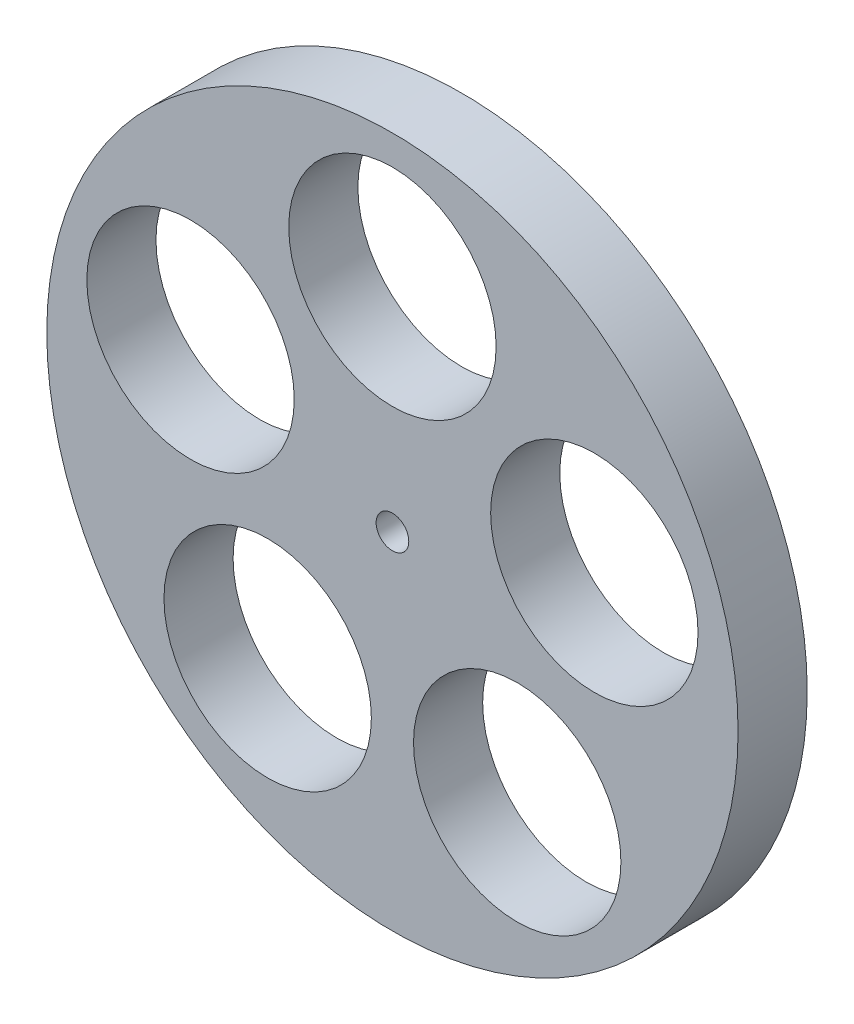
ISO-10303-21;
HEADER;
FILE_DESCRIPTION(('STEP AP214'),'2;1');
FILE_NAME('part.step','',(''),(''),'','','');
FILE_SCHEMA(('AUTOMOTIVE_DESIGN { 1 0 10303 214 1 1 1 1 }'));
ENDSEC;
DATA;
#1=APPLICATION_CONTEXT('core data for automotive mechanical design processes');
#2=APPLICATION_PROTOCOL_DEFINITION('international standard','automotive_design',2000,#1);
#3=PRODUCT_CONTEXT('',#1,'mechanical');
#4=PRODUCT('Part','Part','',(#3));
#5=PRODUCT_RELATED_PRODUCT_CATEGORY('part','',(#4));
#6=PRODUCT_DEFINITION_FORMATION('','',#4);
#7=PRODUCT_DEFINITION_CONTEXT('part definition',#1,'design');
#8=PRODUCT_DEFINITION('design','',#6,#7);
#9=PRODUCT_DEFINITION_SHAPE('','',#8);
#10=(LENGTH_UNIT() NAMED_UNIT(*) SI_UNIT(.MILLI.,.METRE.));
#11=(NAMED_UNIT(*) PLANE_ANGLE_UNIT() SI_UNIT($,.RADIAN.));
#12=(NAMED_UNIT(*) SI_UNIT($,.STERADIAN.) SOLID_ANGLE_UNIT());
#13=UNCERTAINTY_MEASURE_WITH_UNIT(LENGTH_MEASURE(1.E-05),#10,'distance_accuracy_value','');
#14=(GEOMETRIC_REPRESENTATION_CONTEXT(3) GLOBAL_UNCERTAINTY_ASSIGNED_CONTEXT((#13)) GLOBAL_UNIT_ASSIGNED_CONTEXT((#10,
#11,#12)) REPRESENTATION_CONTEXT('',''));
#15=CARTESIAN_POINT('',(0.,0.,0.));
#16=DIRECTION('',(0.,0.,1.));
#17=DIRECTION('',(1.,0.,0.));
#18=AXIS2_PLACEMENT_3D('',#15,#16,#17);
#19=CARTESIAN_POINT('',(0.,0.,12.7));
#20=DIRECTION('',(0.,0.,1.));
#21=DIRECTION('',(1.,0.,0.));
#22=AXIS2_PLACEMENT_3D('',#19,#20,#21);
#23=PLANE('',#22);
#24=CARTESIAN_POINT('',(-22.9236248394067,-31.5516627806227,12.7));
#25=DIRECTION('',(0.,0.,1.));
#26=DIRECTION('',(1.,0.,0.));
#27=AXIS2_PLACEMENT_3D('',#24,#25,#26);
#28=CIRCLE('',#27,19.05);
#29=CARTESIAN_POINT('',(-3.87362483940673,-31.5516627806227,12.7));
#30=VERTEX_POINT('',#29);
#31=EDGE_CURVE('E86',#30,#30,#28,.T.);
#32=ORIENTED_EDGE('',*,*,#31,.F.);
#33=EDGE_LOOP('',(#32));
#34=FACE_BOUND('',#33,.T.);
#35=CARTESIAN_POINT('',(37.091204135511,12.0516627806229,12.7));
#36=DIRECTION('',(0.,0.,1.));
#37=DIRECTION('',(1.,0.,0.));
#38=AXIS2_PLACEMENT_3D('',#35,#36,#37);
#39=CIRCLE('',#38,19.05);
#40=CARTESIAN_POINT('',(56.141204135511,12.0516627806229,12.7));
#41=VERTEX_POINT('',#40);
#42=EDGE_CURVE('E70',#41,#41,#39,.T.);
#43=ORIENTED_EDGE('',*,*,#42,.F.);
#44=EDGE_LOOP('',(#43));
#45=FACE_BOUND('',#44,.T.);
#46=CARTESIAN_POINT('',(0.,0.,12.7));
#47=DIRECTION('',(0.,0.,1.));
#48=DIRECTION('',(1.,0.,0.));
#49=AXIS2_PLACEMENT_3D('',#46,#47,#48);
#50=CIRCLE('',#49,3.);
#51=CARTESIAN_POINT('',(3.,0.,12.7));
#52=VERTEX_POINT('',#51);
#53=EDGE_CURVE('E56',#52,#52,#50,.T.);
#54=ORIENTED_EDGE('',*,*,#53,.F.);
#55=EDGE_LOOP('',(#54));
#56=FACE_BOUND('',#55,.T.);
#57=CARTESIAN_POINT('',(0.,0.,12.7));
#58=DIRECTION('',(0.,0.,1.));
#59=DIRECTION('',(1.,0.,0.));
#60=AXIS2_PLACEMENT_3D('',#57,#58,#59);
#61=CIRCLE('',#60,63.5);
#62=CARTESIAN_POINT('',(63.5,0.,12.7));
#63=VERTEX_POINT('',#62);
#64=EDGE_CURVE('E10',#63,#63,#61,.T.);
#65=ORIENTED_EDGE('',*,*,#64,.T.);
#66=EDGE_LOOP('',(#65));
#67=FACE_BOUND('',#66,.T.);
#68=CARTESIAN_POINT('',(0.,39.,12.7));
#69=DIRECTION('',(0.,0.,1.));
#70=DIRECTION('',(1.,0.,0.));
#71=AXIS2_PLACEMENT_3D('',#68,#69,#70);
#72=CIRCLE('',#71,19.05);
#73=CARTESIAN_POINT('',(19.05,39.,12.7));
#74=VERTEX_POINT('',#73);
#75=EDGE_CURVE('E62',#74,#74,#72,.T.);
#76=ORIENTED_EDGE('',*,*,#75,.F.);
#77=EDGE_LOOP('',(#76));
#78=FACE_BOUND('',#77,.T.);
#79=CARTESIAN_POINT('',(22.9236248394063,-31.5516627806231,12.7));
#80=DIRECTION('',(0.,0.,1.));
#81=DIRECTION('',(1.,0.,0.));
#82=AXIS2_PLACEMENT_3D('',#79,#80,#81);
#83=CIRCLE('',#82,19.05);
#84=CARTESIAN_POINT('',(41.9736248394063,-31.5516627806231,12.7));
#85=VERTEX_POINT('',#84);
#86=EDGE_CURVE('E78',#85,#85,#83,.T.);
#87=ORIENTED_EDGE('',*,*,#86,.F.);
#88=EDGE_LOOP('',(#87));
#89=FACE_BOUND('',#88,.T.);
#90=CARTESIAN_POINT('',(-37.0912041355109,12.0516627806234,12.7));
#91=DIRECTION('',(0.,0.,1.));
#92=DIRECTION('',(1.,0.,0.));
#93=AXIS2_PLACEMENT_3D('',#90,#91,#92);
#94=CIRCLE('',#93,19.05);
#95=CARTESIAN_POINT('',(-18.0412041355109,12.0516627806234,12.7));
#96=VERTEX_POINT('',#95);
#97=EDGE_CURVE('E94',#96,#96,#94,.T.);
#98=ORIENTED_EDGE('',*,*,#97,.F.);
#99=EDGE_LOOP('',(#98));
#100=FACE_BOUND('',#99,.T.);
#101=ADVANCED_FACE('F43',(#34,#45,#56,#67,#78,#89,#100),#23,.T.);
#102=CARTESIAN_POINT('',(0.,0.,0.));
#103=DIRECTION('',(0.,0.,1.));
#104=DIRECTION('',(1.,0.,0.));
#105=AXIS2_PLACEMENT_3D('',#102,#103,#104);
#106=PLANE('',#105);
#107=CARTESIAN_POINT('',(0.,0.,0.));
#108=DIRECTION('',(0.,0.,1.));
#109=DIRECTION('',(1.,0.,0.));
#110=AXIS2_PLACEMENT_3D('',#107,#108,#109);
#111=CIRCLE('',#110,63.5);
#112=CARTESIAN_POINT('',(63.5,0.,0.));
#113=VERTEX_POINT('',#112);
#114=EDGE_CURVE('E47',#113,#113,#111,.T.);
#115=ORIENTED_EDGE('',*,*,#114,.F.);
#116=EDGE_LOOP('',(#115));
#117=FACE_BOUND('',#116,.T.);
#118=CARTESIAN_POINT('',(0.,0.,0.));
#119=DIRECTION('',(0.,0.,1.));
#120=DIRECTION('',(1.,0.,0.));
#121=AXIS2_PLACEMENT_3D('',#118,#119,#120);
#122=CIRCLE('',#121,3.);
#123=CARTESIAN_POINT('',(3.,0.,0.));
#124=VERTEX_POINT('',#123);
#125=EDGE_CURVE('E58',#124,#124,#122,.T.);
#126=ORIENTED_EDGE('',*,*,#125,.T.);
#127=EDGE_LOOP('',(#126));
#128=FACE_BOUND('',#127,.T.);
#129=CARTESIAN_POINT('',(0.,39.,0.));
#130=DIRECTION('',(0.,0.,1.));
#131=DIRECTION('',(1.,0.,0.));
#132=AXIS2_PLACEMENT_3D('',#129,#130,#131);
#133=CIRCLE('',#132,19.05);
#134=CARTESIAN_POINT('',(19.05,39.,0.));
#135=VERTEX_POINT('',#134);
#136=EDGE_CURVE('E66',#135,#135,#133,.T.);
#137=ORIENTED_EDGE('',*,*,#136,.T.);
#138=EDGE_LOOP('',(#137));
#139=FACE_BOUND('',#138,.T.);
#140=CARTESIAN_POINT('',(37.091204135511,12.0516627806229,0.));
#141=DIRECTION('',(0.,0.,1.));
#142=DIRECTION('',(1.,0.,0.));
#143=AXIS2_PLACEMENT_3D('',#140,#141,#142);
#144=CIRCLE('',#143,19.05);
#145=CARTESIAN_POINT('',(56.141204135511,12.0516627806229,0.));
#146=VERTEX_POINT('',#145);
#147=EDGE_CURVE('E74',#146,#146,#144,.T.);
#148=ORIENTED_EDGE('',*,*,#147,.T.);
#149=EDGE_LOOP('',(#148));
#150=FACE_BOUND('',#149,.T.);
#151=CARTESIAN_POINT('',(22.9236248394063,-31.5516627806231,0.));
#152=DIRECTION('',(0.,0.,1.));
#153=DIRECTION('',(1.,0.,0.));
#154=AXIS2_PLACEMENT_3D('',#151,#152,#153);
#155=CIRCLE('',#154,19.05);
#156=CARTESIAN_POINT('',(41.9736248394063,-31.5516627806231,0.));
#157=VERTEX_POINT('',#156);
#158=EDGE_CURVE('E82',#157,#157,#155,.T.);
#159=ORIENTED_EDGE('',*,*,#158,.T.);
#160=EDGE_LOOP('',(#159));
#161=FACE_BOUND('',#160,.T.);
#162=CARTESIAN_POINT('',(-22.9236248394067,-31.5516627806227,0.));
#163=DIRECTION('',(0.,0.,1.));
#164=DIRECTION('',(1.,0.,0.));
#165=AXIS2_PLACEMENT_3D('',#162,#163,#164);
#166=CIRCLE('',#165,19.05);
#167=CARTESIAN_POINT('',(-3.87362483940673,-31.5516627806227,0.));
#168=VERTEX_POINT('',#167);
#169=EDGE_CURVE('E90',#168,#168,#166,.T.);
#170=ORIENTED_EDGE('',*,*,#169,.T.);
#171=EDGE_LOOP('',(#170));
#172=FACE_BOUND('',#171,.T.);
#173=CARTESIAN_POINT('',(-37.0912041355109,12.0516627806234,0.));
#174=DIRECTION('',(0.,0.,1.));
#175=DIRECTION('',(1.,0.,0.));
#176=AXIS2_PLACEMENT_3D('',#173,#174,#175);
#177=CIRCLE('',#176,19.05);
#178=CARTESIAN_POINT('',(-18.0412041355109,12.0516627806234,0.));
#179=VERTEX_POINT('',#178);
#180=EDGE_CURVE('E98',#179,#179,#177,.T.);
#181=ORIENTED_EDGE('',*,*,#180,.T.);
#182=EDGE_LOOP('',(#181));
#183=FACE_BOUND('',#182,.T.);
#184=ADVANCED_FACE('F110',(#117,#128,#139,#150,#161,#172,#183),#106,.F.);
#185=CARTESIAN_POINT('',(0.,0.,12.7));
#186=DIRECTION('',(0.,0.,-1.));
#187=DIRECTION('',(-1.,0.,0.));
#188=AXIS2_PLACEMENT_3D('',#185,#186,#187);
#189=CYLINDRICAL_SURFACE('',#188,63.5);
#190=ORIENTED_EDGE('',*,*,#64,.F.);
#191=EDGE_LOOP('',(#190));
#192=FACE_BOUND('',#191,.T.);
#193=ORIENTED_EDGE('',*,*,#114,.T.);
#194=EDGE_LOOP('',(#193));
#195=FACE_BOUND('',#194,.T.);
#196=ADVANCED_FACE('F45',(#192,#195),#189,.T.);
#197=CARTESIAN_POINT('',(0.,0.,12.7));
#198=DIRECTION('',(0.,0.,-1.));
#199=DIRECTION('',(-1.,0.,0.));
#200=AXIS2_PLACEMENT_3D('',#197,#198,#199);
#201=CYLINDRICAL_SURFACE('',#200,3.);
#202=ORIENTED_EDGE('',*,*,#53,.T.);
#203=EDGE_LOOP('',(#202));
#204=FACE_BOUND('',#203,.T.);
#205=ORIENTED_EDGE('',*,*,#125,.F.);
#206=EDGE_LOOP('',(#205));
#207=FACE_BOUND('',#206,.T.);
#208=ADVANCED_FACE('F120',(#204,#207),#201,.F.);
#209=CARTESIAN_POINT('',(0.,39.,12.7));
#210=DIRECTION('',(0.,0.,-1.));
#211=DIRECTION('',(-1.,0.,0.));
#212=AXIS2_PLACEMENT_3D('',#209,#210,#211);
#213=CYLINDRICAL_SURFACE('',#212,19.05);
#214=ORIENTED_EDGE('',*,*,#75,.T.);
#215=EDGE_LOOP('',(#214));
#216=FACE_BOUND('',#215,.T.);
#217=ORIENTED_EDGE('',*,*,#136,.F.);
#218=EDGE_LOOP('',(#217));
#219=FACE_BOUND('',#218,.T.);
#220=ADVANCED_FACE('F123',(#216,#219),#213,.F.);
#221=CARTESIAN_POINT('',(37.091204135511,12.0516627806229,12.7));
#222=DIRECTION('',(0.,0.,-1.));
#223=DIRECTION('',(-1.,0.,0.));
#224=AXIS2_PLACEMENT_3D('',#221,#222,#223);
#225=CYLINDRICAL_SURFACE('',#224,19.05);
#226=ORIENTED_EDGE('',*,*,#42,.T.);
#227=EDGE_LOOP('',(#226));
#228=FACE_BOUND('',#227,.T.);
#229=ORIENTED_EDGE('',*,*,#147,.F.);
#230=EDGE_LOOP('',(#229));
#231=FACE_BOUND('',#230,.T.);
#232=ADVANCED_FACE('F127',(#228,#231),#225,.F.);
#233=CARTESIAN_POINT('',(22.9236248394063,-31.5516627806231,12.7));
#234=DIRECTION('',(0.,0.,-1.));
#235=DIRECTION('',(-1.,0.,0.));
#236=AXIS2_PLACEMENT_3D('',#233,#234,#235);
#237=CYLINDRICAL_SURFACE('',#236,19.05);
#238=ORIENTED_EDGE('',*,*,#86,.T.);
#239=EDGE_LOOP('',(#238));
#240=FACE_BOUND('',#239,.T.);
#241=ORIENTED_EDGE('',*,*,#158,.F.);
#242=EDGE_LOOP('',(#241));
#243=FACE_BOUND('',#242,.T.);
#244=ADVANCED_FACE('F131',(#240,#243),#237,.F.);
#245=CARTESIAN_POINT('',(-22.9236248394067,-31.5516627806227,12.7));
#246=DIRECTION('',(0.,0.,-1.));
#247=DIRECTION('',(-1.,0.,0.));
#248=AXIS2_PLACEMENT_3D('',#245,#246,#247);
#249=CYLINDRICAL_SURFACE('',#248,19.05);
#250=ORIENTED_EDGE('',*,*,#31,.T.);
#251=EDGE_LOOP('',(#250));
#252=FACE_BOUND('',#251,.T.);
#253=ORIENTED_EDGE('',*,*,#169,.F.);
#254=EDGE_LOOP('',(#253));
#255=FACE_BOUND('',#254,.T.);
#256=ADVANCED_FACE('F135',(#252,#255),#249,.F.);
#257=CARTESIAN_POINT('',(-37.0912041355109,12.0516627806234,12.7));
#258=DIRECTION('',(0.,0.,-1.));
#259=DIRECTION('',(-1.,0.,0.));
#260=AXIS2_PLACEMENT_3D('',#257,#258,#259);
#261=CYLINDRICAL_SURFACE('',#260,19.05);
#262=ORIENTED_EDGE('',*,*,#97,.T.);
#263=EDGE_LOOP('',(#262));
#264=FACE_BOUND('',#263,.T.);
#265=ORIENTED_EDGE('',*,*,#180,.F.);
#266=EDGE_LOOP('',(#265));
#267=FACE_BOUND('',#266,.T.);
#268=ADVANCED_FACE('F106',(#264,#267),#261,.F.);
#269=CLOSED_SHELL('',(#101,#184,#196,#208,#220,#232,#244,#256,#268));
#270=MANIFOLD_SOLID_BREP('B2',#269);
#271=ADVANCED_BREP_SHAPE_REPRESENTATION('',(#18,#270),#14);
#272=SHAPE_DEFINITION_REPRESENTATION(#9,#271);
ENDSEC;
END-ISO-10303-21;
